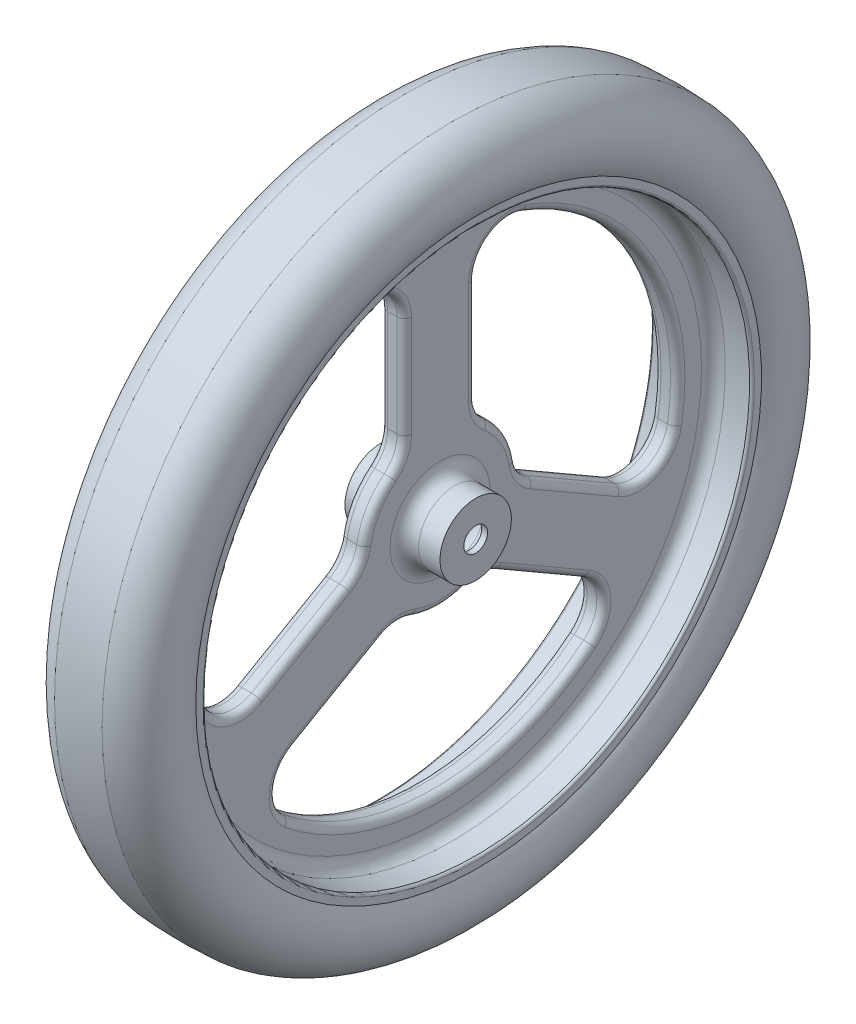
from build123d import *

# Parameters (mm, degrees)
ENL_V_MAT_EXTRU_1_DEPTH = 422.205413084
CONG_1_R                = 6
COQUE1_T                = -5


with BuildPart() as part:
    # Esquisse2 → R_volution1 (revolve)
    with BuildSketch(Plane.XY, mode=Mode.PRIVATE) as r_volution1_sk:
        with BuildLine():
            Line((-22, 30), (-40, 30))
            Line((-40, 30), (-40, 10))
            Line((-40, 10), (40, 10))
            Line((40, 10), (40, 30))
            Line((40, 30), (22, 30))
            ThreePointArc((22, 30), (13.514718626, 33.514718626), (10, 42))
            Line((10, 42), (10, 220))
            ThreePointArc((10, 220), (12.928932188, 227.071067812), (20, 230))
            Line((20, 230), (40.5, 230))
            ThreePointArc((40.5, 230), (41.914213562, 230.585786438), (42.5, 232))
            Line((42.5, 232), (42.5, 237.969278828))
            ThreePointArc((42.5, 237.969278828), (45.290915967, 271.751468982), (20, 294.321253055))
            ThreePointArc((20, 294.321253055), (0, 295), (-20, 294.321253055))
            ThreePointArc((-20, 294.321253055), (-45.290915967, 271.751468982), (-42.5, 237.969278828))
            Line((-42.5, 237.969278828), (-42.5, 232))
            ThreePointArc((-42.5, 232), (-41.914213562, 230.585786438), (-40.5, 230))
            Line((-40.5, 230), (-20, 230))
            ThreePointArc((-20, 230), (-12.928932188, 227.071067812), (-10, 220))
            Line((-10, 220), (-10, 42))
            ThreePointArc((-10, 42), (-13.514718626, 33.514718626), (-22, 30))
        make_face()
    revolve(r_volution1_sk.sketch.rotate(Axis((-52.801460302, 0, 0), (1, 0, 0)), 90), axis=Axis((-52.801460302, 0, 0), (1, 0, 0)))

    # Esquisse3 → Enl_v. mat.-Extru.1 (cut, through all)
    with BuildSketch(Plane(origin=(10, 0, 0), x_dir=(0, 0, -1), z_dir=(1, 0, 0))):
        with BuildLine():
            Line((30, 73.654599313), (30, 159.059737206))
            ThreePointArc((30, 159.059737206), (42.93610623, 183.734086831), (70.588235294, 187.129102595))
            ThreePointArc((70.588235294, 187.129102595), (173.205080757, 100), (197.352674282, -32.433346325))
            ThreePointArc((197.352674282, -32.433346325), (180.586439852, -54.68328468), (152.74977314, -53.549106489))
            Line((152.74977314, -53.549106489), (78.786754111, -10.846537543))
            ThreePointArc((78.786754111, -10.846537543), (69.087715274, -1.893913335), (64.169884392, 10.354995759))
            ThreePointArc((64.169884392, 10.354995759), (56.291651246, 32.5), (41.052631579, 50.395252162))
            ThreePointArc((41.052631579, 50.395252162), (32.903680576, 60.778673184), (30, 73.654599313))
        make_face()
        with BuildLine():
            Line((48.786754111, -62.80806177), (122.74977314, -105.510630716))
            ThreePointArc((122.74977314, -105.510630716), (137.650333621, -129.05080215), (126.764438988, -154.695756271))
            ThreePointArc((126.764438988, -154.695756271), (0, -200), (-126.764438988, -154.695756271))
            ThreePointArc((-126.764438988, -154.695756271), (-137.650333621, -129.05080215), (-122.74977314, -105.510630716))
            Line((-122.74977314, -105.510630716), (-48.786754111, -62.80806177))
            ThreePointArc((-48.786754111, -62.80806177), (-36.184034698, -58.884759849), (-23.117252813, -60.75024792))
            ThreePointArc((-23.117252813, -60.75024792), (0, -65), (23.117252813, -60.75024792))
            ThreePointArc((23.117252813, -60.75024792), (36.184034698, -58.884759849), (48.786754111, -62.80806177))
        make_face()
        with BuildLine():
            Line((-78.786754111, -10.846537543), (-152.74977314, -53.549106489))
            ThreePointArc((-152.74977314, -53.549106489), (-180.586439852, -54.68328468), (-197.352674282, -32.433346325))
            ThreePointArc((-197.352674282, -32.433346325), (-173.205080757, 100), (-70.588235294, 187.129102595))
            ThreePointArc((-70.588235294, 187.129102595), (-42.93610623, 183.734086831), (-30, 159.059737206))
            Line((-30, 159.059737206), (-30, 73.654599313))
            ThreePointArc((-30, 73.654599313), (-32.903680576, 60.778673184), (-41.052631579, 50.395252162))
            ThreePointArc((-41.052631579, 50.395252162), (-56.291651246, 32.5), (-64.169884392, 10.354995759))
            ThreePointArc((-64.169884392, 10.354995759), (-69.087715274, -1.893913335), (-78.786754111, -10.846537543))
        make_face()
    extrude(amount=-ENL_V_MAT_EXTRU_1_DEPTH, mode=Mode.SUBTRACT)

    # Cong_1
    cong_1_edges = [part.edges().sort_by_distance(p)[0] for p in [
        (-10, -32.197822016, 115.768263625),
        (-10, -1.893913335, 69.087715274),
        (-10, 32.5, 56.291651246),
        (-10, 60.778673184, 32.903680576),
        (-10, 116.35716826, 30),
        (-10, 183.734086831, 42.93610623),
        (-10, 100, 173.205080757),
        (-10, -54.68328468, 180.586439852),
        (10, -54.68328468, 180.586439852),
        (10, -32.197822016, 115.768263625),
        (10, -1.893913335, 69.087715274),
        (10, 32.5, 56.291651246),
        (10, 60.778673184, 32.903680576),
        (10, 116.35716826, 30),
        (10, 183.734086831, 42.93610623),
        (10, 100, 173.205080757),
        (-10, 116.35716826, -30),
        (-10, 60.778673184, -32.903680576),
        (-10, 32.5, -56.291651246),
        (-10, -1.893913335, -69.087715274),
        (-10, -32.197822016, -115.768263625),
        (-10, -54.68328468, -180.586439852),
        (-10, 100, -173.205080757),
        (-10, 183.734086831, -42.93610623),
        (10, 183.734086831, -42.93610623),
        (10, 116.35716826, -30),
        (10, 60.778673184, -32.903680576),
        (10, 32.5, -56.291651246),
        (10, -1.893913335, -69.087715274),
        (10, -32.197822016, -115.768263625),
        (10, -54.68328468, -180.586439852),
        (10, 100, -173.205080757),
        (-10, -84.159346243, -85.768263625),
        (-10, -58.884759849, -36.184034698),
        (-10, -65, 0),
        (-10, -58.884759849, 36.184034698),
        (-10, -84.159346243, 85.768263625),
        (-10, -129.05080215, 137.650333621),
        (-10, -200, 0),
        (-10, -129.05080215, -137.650333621),
        (10, -129.05080215, -137.650333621),
        (10, -84.159346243, -85.768263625),
        (10, -58.884759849, -36.184034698),
        (10, -65, 0),
        (10, -58.884759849, 36.184034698),
        (10, -84.159346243, 85.768263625),
        (10, -129.05080215, 137.650333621),
        (10, -200, 0),
    ]]
    fillet(cong_1_edges, radius=CONG_1_R)

    # Coque1
    coque1_openings = [part.faces().sort_by_distance(p)[0] for p in [
        (0, 0, -10),
    ]]
    offset(amount=COQUE1_T, openings=coque1_openings, kind=Kind.INTERSECTION)


solid = part.part
